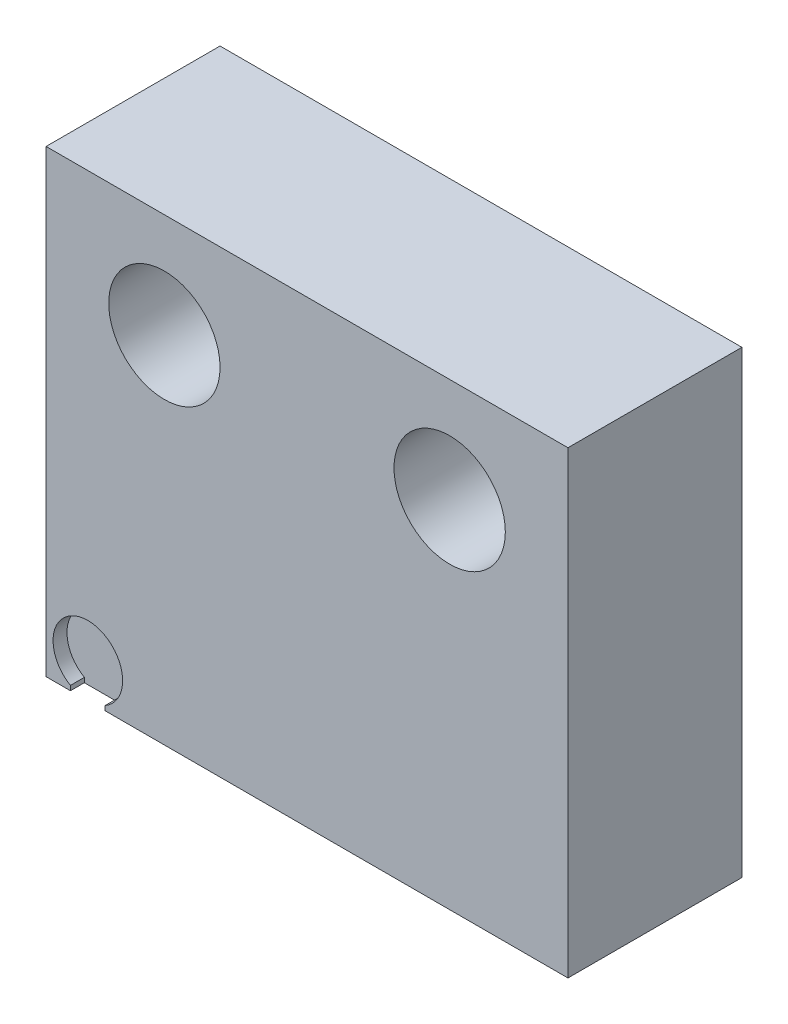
ISO-10303-21;
HEADER;
FILE_DESCRIPTION(('STEP AP214'),'2;1');
FILE_NAME('part.step','',(''),(''),'','','');
FILE_SCHEMA(('AUTOMOTIVE_DESIGN { 1 0 10303 214 1 1 1 1 }'));
ENDSEC;
DATA;
#1=APPLICATION_CONTEXT('core data for automotive mechanical design processes');
#2=APPLICATION_PROTOCOL_DEFINITION('international standard','automotive_design',2000,#1);
#3=PRODUCT_CONTEXT('',#1,'mechanical');
#4=PRODUCT('Part','Part','',(#3));
#5=PRODUCT_RELATED_PRODUCT_CATEGORY('part','',(#4));
#6=PRODUCT_DEFINITION_FORMATION('','',#4);
#7=PRODUCT_DEFINITION_CONTEXT('part definition',#1,'design');
#8=PRODUCT_DEFINITION('design','',#6,#7);
#9=PRODUCT_DEFINITION_SHAPE('','',#8);
#10=(LENGTH_UNIT() NAMED_UNIT(*) SI_UNIT(.MILLI.,.METRE.));
#11=(NAMED_UNIT(*) PLANE_ANGLE_UNIT() SI_UNIT($,.RADIAN.));
#12=(NAMED_UNIT(*) SI_UNIT($,.STERADIAN.) SOLID_ANGLE_UNIT());
#13=UNCERTAINTY_MEASURE_WITH_UNIT(LENGTH_MEASURE(1.E-05),#10,'distance_accuracy_value','');
#14=(GEOMETRIC_REPRESENTATION_CONTEXT(3) GLOBAL_UNCERTAINTY_ASSIGNED_CONTEXT((#13)) GLOBAL_UNIT_ASSIGNED_CONTEXT((#10,
#11,#12)) REPRESENTATION_CONTEXT('',''));
#15=CARTESIAN_POINT('',(0.,0.,0.));
#16=DIRECTION('',(0.,0.,1.));
#17=DIRECTION('',(1.,0.,0.));
#18=AXIS2_PLACEMENT_3D('',#15,#16,#17);
#19=CARTESIAN_POINT('',(2.2,0.,1.75));
#20=DIRECTION('',(0.,0.,1.));
#21=DIRECTION('',(1.,0.,0.));
#22=AXIS2_PLACEMENT_3D('',#19,#20,#21);
#23=PLANE('',#22);
#24=DIRECTION('',(0.,1.,0.));
#25=VECTOR('',#24,1.);
#26=CARTESIAN_POINT('',(1.,0.,1.75));
#27=LINE('',#26,#25);
#28=CARTESIAN_POINT('',(1.,0.,1.75));
#29=VERTEX_POINT('',#28);
#30=CARTESIAN_POINT('',(1.,2.,1.75));
#31=VERTEX_POINT('',#30);
#32=EDGE_CURVE('E102',#29,#31,#27,.T.);
#33=ORIENTED_EDGE('',*,*,#32,.T.);
#34=DIRECTION('',(1.,0.,0.));
#35=VECTOR('',#34,1.);
#36=CARTESIAN_POINT('',(3.75,2.,1.75));
#37=LINE('',#36,#35);
#38=CARTESIAN_POINT('',(2.2,2.,1.75));
#39=VERTEX_POINT('',#38);
#40=EDGE_CURVE('E247',#39,#31,#37,.F.);
#41=ORIENTED_EDGE('',*,*,#40,.F.);
#42=DIRECTION('',(0.,1.,0.));
#43=VECTOR('',#42,1.);
#44=CARTESIAN_POINT('',(2.2,0.,1.75));
#45=LINE('',#44,#43);
#46=CARTESIAN_POINT('',(2.2,0.,1.75));
#47=VERTEX_POINT('',#46);
#48=EDGE_CURVE('E241',#39,#47,#45,.F.);
#49=ORIENTED_EDGE('',*,*,#48,.T.);
#50=DIRECTION('',(1.,0.,0.));
#51=VECTOR('',#50,1.);
#52=CARTESIAN_POINT('',(2.2,0.,1.75));
#53=LINE('',#52,#51);
#54=EDGE_CURVE('E80',#29,#47,#53,.T.);
#55=ORIENTED_EDGE('',*,*,#54,.F.);
#56=EDGE_LOOP('',(#33,#41,#49,#55));
#57=FACE_BOUND('',#56,.T.);
#58=ADVANCED_FACE('F17',(#57),#23,.F.);
#59=CARTESIAN_POINT('',(3.75,3.3,2.3));
#60=DIRECTION('',(0.,0.,1.));
#61=DIRECTION('',(1.,0.,0.));
#62=AXIS2_PLACEMENT_3D('',#59,#60,#61);
#63=PLANE('',#62);
#64=CARTESIAN_POINT('',(0.6,0.5,2.3));
#65=DIRECTION('',(0.,0.,1.));
#66=DIRECTION('',(1.,0.,0.));
#67=AXIS2_PLACEMENT_3D('',#64,#65,#66);
#68=CIRCLE('',#67,0.5);
#69=CARTESIAN_POINT('',(0.85,0.0669872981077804,2.3));
#70=VERTEX_POINT('',#69);
#71=CARTESIAN_POINT('',(0.35,0.0669872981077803,2.3));
#72=VERTEX_POINT('',#71);
#73=EDGE_CURVE('E20',#70,#72,#68,.T.);
#74=ORIENTED_EDGE('',*,*,#73,.T.);
#75=DIRECTION('',(0.,1.,0.));
#76=VECTOR('',#75,1.);
#77=CARTESIAN_POINT('',(0.35,3.3,2.3));
#78=LINE('',#77,#76);
#79=CARTESIAN_POINT('',(0.35,0.,2.3));
#80=VERTEX_POINT('',#79);
#81=EDGE_CURVE('E97',#72,#80,#78,.F.);
#82=ORIENTED_EDGE('',*,*,#81,.T.);
#83=DIRECTION('',(1.,0.,0.));
#84=VECTOR('',#83,1.);
#85=CARTESIAN_POINT('',(3.75,0.,2.3));
#86=LINE('',#85,#84);
#87=CARTESIAN_POINT('',(0.85,0.,2.3));
#88=VERTEX_POINT('',#87);
#89=EDGE_CURVE('E95',#80,#88,#86,.T.);
#90=ORIENTED_EDGE('',*,*,#89,.T.);
#91=DIRECTION('',(0.,1.,0.));
#92=VECTOR('',#91,1.);
#93=CARTESIAN_POINT('',(0.85,3.3,2.3));
#94=LINE('',#93,#92);
#95=EDGE_CURVE('E69',#88,#70,#94,.T.);
#96=ORIENTED_EDGE('',*,*,#95,.T.);
#97=EDGE_LOOP('',(#74,#82,#90,#96));
#98=FACE_BOUND('',#97,.T.);
#99=ADVANCED_FACE('F99',(#98),#63,.T.);
#100=CARTESIAN_POINT('',(1.,0.,1.75));
#101=DIRECTION('',(-1.,0.,0.));
#102=DIRECTION('',(0.,0.,1.));
#103=AXIS2_PLACEMENT_3D('',#100,#101,#102);
#104=PLANE('',#103);
#105=DIRECTION('',(0.,1.,0.));
#106=VECTOR('',#105,1.);
#107=CARTESIAN_POINT('',(1.,0.,0.75));
#108=LINE('',#107,#106);
#109=CARTESIAN_POINT('',(1.,0.,0.75));
#110=VERTEX_POINT('',#109);
#111=CARTESIAN_POINT('',(1.,2.,0.75));
#112=VERTEX_POINT('',#111);
#113=EDGE_CURVE('E201',#110,#112,#108,.T.);
#114=ORIENTED_EDGE('',*,*,#113,.T.);
#115=DIRECTION('',(0.,0.,-1.));
#116=VECTOR('',#115,1.);
#117=CARTESIAN_POINT('',(1.,2.,1.25));
#118=LINE('',#117,#116);
#119=EDGE_CURVE('E250',#31,#112,#118,.T.);
#120=ORIENTED_EDGE('',*,*,#119,.F.);
#121=ORIENTED_EDGE('',*,*,#32,.F.);
#122=DIRECTION('',(0.,0.,1.));
#123=VECTOR('',#122,1.);
#124=CARTESIAN_POINT('',(1.,0.,1.75));
#125=LINE('',#124,#123);
#126=EDGE_CURVE('E253',#110,#29,#125,.T.);
#127=ORIENTED_EDGE('',*,*,#126,.F.);
#128=EDGE_LOOP('',(#114,#120,#121,#127));
#129=FACE_BOUND('',#128,.T.);
#130=ADVANCED_FACE('F268',(#129),#104,.F.);
#131=CARTESIAN_POINT('',(3.75,2.,1.25));
#132=DIRECTION('',(0.,-1.,0.));
#133=DIRECTION('',(0.,0.,-1.));
#134=AXIS2_PLACEMENT_3D('',#131,#132,#133);
#135=PLANE('',#134);
#136=DIRECTION('',(0.,0.,-1.));
#137=VECTOR('',#136,1.);
#138=CARTESIAN_POINT('',(2.2,2.,0.75));
#139=LINE('',#138,#137);
#140=CARTESIAN_POINT('',(2.2,2.,0.75));
#141=VERTEX_POINT('',#140);
#142=EDGE_CURVE('E244',#141,#39,#139,.F.);
#143=ORIENTED_EDGE('',*,*,#142,.T.);
#144=ORIENTED_EDGE('',*,*,#40,.T.);
#145=ORIENTED_EDGE('',*,*,#119,.T.);
#146=DIRECTION('',(-1.,0.,0.));
#147=VECTOR('',#146,1.);
#148=CARTESIAN_POINT('',(1.,2.,0.75));
#149=LINE('',#148,#147);
#150=EDGE_CURVE('E198',#112,#141,#149,.F.);
#151=ORIENTED_EDGE('',*,*,#150,.T.);
#152=EDGE_LOOP('',(#143,#144,#145,#151));
#153=FACE_BOUND('',#152,.T.);
#154=ADVANCED_FACE('F265',(#153),#135,.T.);
#155=CARTESIAN_POINT('',(2.2,0.,0.75));
#156=DIRECTION('',(1.,0.,0.));
#157=DIRECTION('',(0.,0.,-1.));
#158=AXIS2_PLACEMENT_3D('',#155,#156,#157);
#159=PLANE('',#158);
#160=ORIENTED_EDGE('',*,*,#48,.F.);
#161=ORIENTED_EDGE('',*,*,#142,.F.);
#162=DIRECTION('',(0.,1.,0.));
#163=VECTOR('',#162,1.);
#164=CARTESIAN_POINT('',(2.2,0.,0.75));
#165=LINE('',#164,#163);
#166=CARTESIAN_POINT('',(2.2,0.,0.75));
#167=VERTEX_POINT('',#166);
#168=EDGE_CURVE('E195',#141,#167,#165,.F.);
#169=ORIENTED_EDGE('',*,*,#168,.T.);
#170=DIRECTION('',(0.,0.,-1.));
#171=VECTOR('',#170,1.);
#172=CARTESIAN_POINT('',(2.2,0.,0.75));
#173=LINE('',#172,#171);
#174=EDGE_CURVE('E239',#47,#167,#173,.T.);
#175=ORIENTED_EDGE('',*,*,#174,.F.);
#176=EDGE_LOOP('',(#160,#161,#169,#175));
#177=FACE_BOUND('',#176,.T.);
#178=ADVANCED_FACE('F410',(#177),#159,.F.);
#179=CARTESIAN_POINT('',(0.3,3.3,1.25));
#180=DIRECTION('',(-1.,0.,0.));
#181=DIRECTION('',(0.,0.,1.));
#182=AXIS2_PLACEMENT_3D('',#179,#180,#181);
#183=PLANE('',#182);
#184=DIRECTION('',(0.,0.,1.));
#185=VECTOR('',#184,1.);
#186=CARTESIAN_POINT('',(0.3,1.6,2.15));
#187=LINE('',#186,#185);
#188=CARTESIAN_POINT('',(0.3,1.6,2.15));
#189=VERTEX_POINT('',#188);
#190=CARTESIAN_POINT('',(0.3,1.6,0.35));
#191=VERTEX_POINT('',#190);
#192=EDGE_CURVE('E186',#189,#191,#187,.F.);
#193=ORIENTED_EDGE('',*,*,#192,.T.);
#194=DIRECTION('',(0.,1.,0.));
#195=VECTOR('',#194,1.);
#196=CARTESIAN_POINT('',(0.3,1.6,0.35));
#197=LINE('',#196,#195);
#198=CARTESIAN_POINT('',(0.299999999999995,0.399999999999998,0.35));
#199=VERTEX_POINT('',#198);
#200=EDGE_CURVE('E189',#191,#199,#197,.F.);
#201=ORIENTED_EDGE('',*,*,#200,.T.);
#202=DIRECTION('',(0.,0.,1.));
#203=VECTOR('',#202,1.);
#204=CARTESIAN_POINT('',(0.299999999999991,0.399999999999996,1.25));
#205=LINE('',#204,#203);
#206=CARTESIAN_POINT('',(0.299999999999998,0.399999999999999,2.15));
#207=VERTEX_POINT('',#206);
#208=EDGE_CURVE('E217',#207,#199,#205,.F.);
#209=ORIENTED_EDGE('',*,*,#208,.F.);
#210=DIRECTION('',(0.,1.,0.));
#211=VECTOR('',#210,1.);
#212=CARTESIAN_POINT('',(0.3,3.3,2.15));
#213=LINE('',#212,#211);
#214=EDGE_CURVE('E236',#207,#189,#213,.T.);
#215=ORIENTED_EDGE('',*,*,#214,.T.);
#216=EDGE_LOOP('',(#193,#201,#209,#215));
#217=FACE_BOUND('',#216,.T.);
#218=ADVANCED_FACE('F401',(#217),#183,.T.);
#219=CARTESIAN_POINT('',(0.6,0.5,2.5));
#220=DIRECTION('',(0.,0.,1.));
#221=DIRECTION('',(1.,0.,0.));
#222=AXIS2_PLACEMENT_3D('',#219,#220,#221);
#223=CYLINDRICAL_SURFACE('',#222,0.5);
#224=DIRECTION('',(0.,0.,1.));
#225=VECTOR('',#224,1.);
#226=CARTESIAN_POINT('',(0.35,0.06698729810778,2.5));
#227=LINE('',#226,#225);
#228=CARTESIAN_POINT('',(0.35,0.0669872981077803,2.5));
#229=VERTEX_POINT('',#228);
#230=EDGE_CURVE('E204',#229,#72,#227,.F.);
#231=ORIENTED_EDGE('',*,*,#230,.T.);
#232=ORIENTED_EDGE('',*,*,#73,.F.);
#233=DIRECTION('',(0.,0.,-1.));
#234=VECTOR('',#233,1.);
#235=CARTESIAN_POINT('',(0.85,0.06698729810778,2.5));
#236=LINE('',#235,#234);
#237=CARTESIAN_POINT('',(0.85,0.0669872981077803,2.5));
#238=VERTEX_POINT('',#237);
#239=EDGE_CURVE('E220',#70,#238,#236,.F.);
#240=ORIENTED_EDGE('',*,*,#239,.T.);
#241=CARTESIAN_POINT('',(0.6,0.5,2.5));
#242=DIRECTION('',(0.,0.,1.));
#243=DIRECTION('',(1.,0.,0.));
#244=AXIS2_PLACEMENT_3D('',#241,#242,#243);
#245=CIRCLE('',#244,0.5);
#246=EDGE_CURVE('E142',#229,#238,#245,.F.);
#247=ORIENTED_EDGE('',*,*,#246,.F.);
#248=EDGE_LOOP('',(#231,#232,#240,#247));
#249=FACE_BOUND('',#248,.T.);
#250=ADVANCED_FACE('F398',(#249),#223,.F.);
#251=CARTESIAN_POINT('',(0.4,0.2,1.25));
#252=DIRECTION('',(-0.894427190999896,-0.447213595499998,0.));
#253=DIRECTION('',(0.447213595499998,-0.894427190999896,0.));
#254=AXIS2_PLACEMENT_3D('',#251,#252,#253);
#255=PLANE('',#254);
#256=DIRECTION('',(0.,0.,-1.));
#257=VECTOR('',#256,1.);
#258=CARTESIAN_POINT('',(0.5,0.,0.));
#259=LINE('',#258,#257);
#260=CARTESIAN_POINT('',(0.500000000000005,0.,2.15));
#261=VERTEX_POINT('',#260);
#262=CARTESIAN_POINT('',(0.500000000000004,0.,0.35));
#263=VERTEX_POINT('',#262);
#264=EDGE_CURVE('E162',#261,#263,#259,.T.);
#265=ORIENTED_EDGE('',*,*,#264,.F.);
#266=DIRECTION('',(-0.447213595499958,0.894427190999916,0.));
#267=VECTOR('',#266,1.);
#268=CARTESIAN_POINT('',(0.5,0.,2.15));
#269=LINE('',#268,#267);
#270=EDGE_CURVE('E153',#261,#207,#269,.T.);
#271=ORIENTED_EDGE('',*,*,#270,.T.);
#272=ORIENTED_EDGE('',*,*,#208,.T.);
#273=DIRECTION('',(0.447213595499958,-0.894427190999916,0.));
#274=VECTOR('',#273,1.);
#275=CARTESIAN_POINT('',(0.3,0.4,0.35));
#276=LINE('',#275,#274);
#277=EDGE_CURVE('E192',#199,#263,#276,.T.);
#278=ORIENTED_EDGE('',*,*,#277,.T.);
#279=EDGE_LOOP('',(#265,#271,#272,#278));
#280=FACE_BOUND('',#279,.T.);
#281=ADVANCED_FACE('F400',(#280),#255,.T.);
#282=CARTESIAN_POINT('',(0.85,0.,2.5));
#283=DIRECTION('',(1.,0.,0.));
#284=DIRECTION('',(0.,0.,-1.));
#285=AXIS2_PLACEMENT_3D('',#282,#283,#284);
#286=PLANE('',#285);
#287=ORIENTED_EDGE('',*,*,#239,.F.);
#288=ORIENTED_EDGE('',*,*,#95,.F.);
#289=DIRECTION('',(0.,0.,-1.));
#290=VECTOR('',#289,1.);
#291=CARTESIAN_POINT('',(0.85,0.,0.));
#292=LINE('',#291,#290);
#293=CARTESIAN_POINT('',(0.85,0.,2.5));
#294=VERTEX_POINT('',#293);
#295=EDGE_CURVE('E114',#294,#88,#292,.T.);
#296=ORIENTED_EDGE('',*,*,#295,.F.);
#297=DIRECTION('',(0.,1.,0.));
#298=VECTOR('',#297,1.);
#299=CARTESIAN_POINT('',(0.85,0.,2.5));
#300=LINE('',#299,#298);
#301=EDGE_CURVE('E143',#238,#294,#300,.F.);
#302=ORIENTED_EDGE('',*,*,#301,.F.);
#303=EDGE_LOOP('',(#287,#288,#296,#302));
#304=FACE_BOUND('',#303,.T.);
#305=ADVANCED_FACE('F396',(#304),#286,.F.);
#306=CARTESIAN_POINT('',(0.35,0.06698729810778,2.5));
#307=DIRECTION('',(-1.,0.,0.));
#308=DIRECTION('',(0.,0.,1.));
#309=AXIS2_PLACEMENT_3D('',#306,#307,#308);
#310=PLANE('',#309);
#311=DIRECTION('',(0.,0.,-1.));
#312=VECTOR('',#311,1.);
#313=CARTESIAN_POINT('',(0.35,0.,0.));
#314=LINE('',#313,#312);
#315=CARTESIAN_POINT('',(0.35,0.,2.5));
#316=VERTEX_POINT('',#315);
#317=EDGE_CURVE('E106',#80,#316,#314,.F.);
#318=ORIENTED_EDGE('',*,*,#317,.F.);
#319=ORIENTED_EDGE('',*,*,#81,.F.);
#320=ORIENTED_EDGE('',*,*,#230,.F.);
#321=DIRECTION('',(0.,1.,0.));
#322=VECTOR('',#321,1.);
#323=CARTESIAN_POINT('',(0.35,0.,2.5));
#324=LINE('',#323,#322);
#325=EDGE_CURVE('E109',#316,#229,#324,.T.);
#326=ORIENTED_EDGE('',*,*,#325,.F.);
#327=EDGE_LOOP('',(#318,#319,#320,#326));
#328=FACE_BOUND('',#327,.T.);
#329=ADVANCED_FACE('F107',(#328),#310,.F.);
#330=CARTESIAN_POINT('',(1.,0.,0.75));
#331=DIRECTION('',(0.,0.,-1.));
#332=DIRECTION('',(-1.,0.,0.));
#333=AXIS2_PLACEMENT_3D('',#330,#331,#332);
#334=PLANE('',#333);
#335=ORIENTED_EDGE('',*,*,#168,.F.);
#336=ORIENTED_EDGE('',*,*,#150,.F.);
#337=ORIENTED_EDGE('',*,*,#113,.F.);
#338=DIRECTION('',(1.,0.,0.));
#339=VECTOR('',#338,1.);
#340=CARTESIAN_POINT('',(0.,0.,0.75));
#341=LINE('',#340,#339);
#342=EDGE_CURVE('E279',#167,#110,#341,.F.);
#343=ORIENTED_EDGE('',*,*,#342,.F.);
#344=EDGE_LOOP('',(#335,#336,#337,#343));
#345=FACE_BOUND('',#344,.T.);
#346=ADVANCED_FACE('F277',(#345),#334,.F.);
#347=CARTESIAN_POINT('',(0.,1.6,0.35));
#348=DIRECTION('',(0.,0.,-1.));
#349=DIRECTION('',(-1.,0.,0.));
#350=AXIS2_PLACEMENT_3D('',#347,#348,#349);
#351=PLANE('',#350);
#352=DIRECTION('',(1.,0.,0.));
#353=VECTOR('',#352,1.);
#354=CARTESIAN_POINT('',(0.,1.6,0.35));
#355=LINE('',#354,#353);
#356=CARTESIAN_POINT('',(0.,1.6,0.35));
#357=VERTEX_POINT('',#356);
#358=EDGE_CURVE('E183',#191,#357,#355,.F.);
#359=ORIENTED_EDGE('',*,*,#358,.T.);
#360=DIRECTION('',(0.,1.,0.));
#361=VECTOR('',#360,1.);
#362=CARTESIAN_POINT('',(0.,6.6,0.35));
#363=LINE('',#362,#361);
#364=CARTESIAN_POINT('',(0.,0.,0.35));
#365=VERTEX_POINT('',#364);
#366=EDGE_CURVE('E347',#365,#357,#363,.T.);
#367=ORIENTED_EDGE('',*,*,#366,.F.);
#368=DIRECTION('',(1.,0.,0.));
#369=VECTOR('',#368,1.);
#370=CARTESIAN_POINT('',(0.,0.,0.35));
#371=LINE('',#370,#369);
#372=EDGE_CURVE('E173',#263,#365,#371,.F.);
#373=ORIENTED_EDGE('',*,*,#372,.F.);
#374=ORIENTED_EDGE('',*,*,#277,.F.);
#375=ORIENTED_EDGE('',*,*,#200,.F.);
#376=EDGE_LOOP('',(#359,#367,#373,#374,#375));
#377=FACE_BOUND('',#376,.T.);
#378=ADVANCED_FACE('F464',(#377),#351,.F.);
#379=CARTESIAN_POINT('',(0.,1.6,2.15));
#380=DIRECTION('',(0.,1.,0.));
#381=DIRECTION('',(0.,0.,1.));
#382=AXIS2_PLACEMENT_3D('',#379,#380,#381);
#383=PLANE('',#382);
#384=ORIENTED_EDGE('',*,*,#358,.F.);
#385=ORIENTED_EDGE('',*,*,#192,.F.);
#386=DIRECTION('',(1.,0.,0.));
#387=VECTOR('',#386,1.);
#388=CARTESIAN_POINT('',(0.,1.6,2.15));
#389=LINE('',#388,#387);
#390=CARTESIAN_POINT('',(0.,1.6,2.15));
#391=VERTEX_POINT('',#390);
#392=EDGE_CURVE('E150',#189,#391,#389,.F.);
#393=ORIENTED_EDGE('',*,*,#392,.T.);
#394=DIRECTION('',(0.,0.,1.));
#395=VECTOR('',#394,1.);
#396=CARTESIAN_POINT('',(0.,1.6,0.));
#397=LINE('',#396,#395);
#398=EDGE_CURVE('E344',#357,#391,#397,.T.);
#399=ORIENTED_EDGE('',*,*,#398,.F.);
#400=EDGE_LOOP('',(#384,#385,#393,#399));
#401=FACE_BOUND('',#400,.T.);
#402=ADVANCED_FACE('F460',(#401),#383,.F.);
#403=CARTESIAN_POINT('',(0.,0.,2.15));
#404=DIRECTION('',(0.,0.,1.));
#405=DIRECTION('',(1.,0.,0.));
#406=AXIS2_PLACEMENT_3D('',#403,#404,#405);
#407=PLANE('',#406);
#408=DIRECTION('',(0.,1.,0.));
#409=VECTOR('',#408,1.);
#410=CARTESIAN_POINT('',(0.,6.6,2.15));
#411=LINE('',#410,#409);
#412=CARTESIAN_POINT('',(0.,0.,2.15));
#413=VERTEX_POINT('',#412);
#414=EDGE_CURVE('E341',#391,#413,#411,.F.);
#415=ORIENTED_EDGE('',*,*,#414,.F.);
#416=ORIENTED_EDGE('',*,*,#392,.F.);
#417=ORIENTED_EDGE('',*,*,#214,.F.);
#418=ORIENTED_EDGE('',*,*,#270,.F.);
#419=DIRECTION('',(1.,0.,0.));
#420=VECTOR('',#419,1.);
#421=CARTESIAN_POINT('',(0.,0.,2.15));
#422=LINE('',#421,#420);
#423=EDGE_CURVE('E233',#413,#261,#422,.T.);
#424=ORIENTED_EDGE('',*,*,#423,.F.);
#425=EDGE_LOOP('',(#415,#416,#417,#418,#424));
#426=FACE_BOUND('',#425,.T.);
#427=ADVANCED_FACE('F456',(#426),#407,.F.);
#428=CARTESIAN_POINT('',(0.,0.,0.2));
#429=DIRECTION('',(0.,0.,1.));
#430=DIRECTION('',(1.,0.,0.));
#431=AXIS2_PLACEMENT_3D('',#428,#429,#430);
#432=PLANE('',#431);
#433=DIRECTION('',(0.,1.,0.));
#434=VECTOR('',#433,1.);
#435=CARTESIAN_POINT('',(0.35,0.06698729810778,0.2));
#436=LINE('',#435,#434);
#437=CARTESIAN_POINT('',(0.35,0.,0.2));
#438=VERTEX_POINT('',#437);
#439=CARTESIAN_POINT('',(0.35,0.0669872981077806,0.2));
#440=VERTEX_POINT('',#439);
#441=EDGE_CURVE('E165',#438,#440,#436,.T.);
#442=ORIENTED_EDGE('',*,*,#441,.T.);
#443=CARTESIAN_POINT('',(0.6,0.5,0.2));
#444=DIRECTION('',(0.,0.,1.));
#445=DIRECTION('',(1.,0.,0.));
#446=AXIS2_PLACEMENT_3D('',#443,#444,#445);
#447=CIRCLE('',#446,0.5);
#448=CARTESIAN_POINT('',(0.85,0.0669872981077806,0.2));
#449=VERTEX_POINT('',#448);
#450=EDGE_CURVE('E140',#440,#449,#447,.F.);
#451=ORIENTED_EDGE('',*,*,#450,.T.);
#452=DIRECTION('',(0.,1.,0.));
#453=VECTOR('',#452,1.);
#454=CARTESIAN_POINT('',(0.85,0.,0.2));
#455=LINE('',#454,#453);
#456=CARTESIAN_POINT('',(0.85,0.,0.2));
#457=VERTEX_POINT('',#456);
#458=EDGE_CURVE('E148',#449,#457,#455,.F.);
#459=ORIENTED_EDGE('',*,*,#458,.T.);
#460=DIRECTION('',(1.,0.,0.));
#461=VECTOR('',#460,1.);
#462=CARTESIAN_POINT('',(0.,0.,0.2));
#463=LINE('',#462,#461);
#464=EDGE_CURVE('E172',#438,#457,#463,.T.);
#465=ORIENTED_EDGE('',*,*,#464,.F.);
#466=EDGE_LOOP('',(#442,#451,#459,#465));
#467=FACE_BOUND('',#466,.T.);
#468=ADVANCED_FACE('F452',(#467),#432,.F.);
#469=CARTESIAN_POINT('',(0.,0.,2.5));
#470=DIRECTION('',(0.,0.,1.));
#471=DIRECTION('',(1.,0.,0.));
#472=AXIS2_PLACEMENT_3D('',#469,#470,#471);
#473=PLANE('',#472);
#474=CARTESIAN_POINT('',(5.8,5.1,2.5));
#475=DIRECTION('',(0.,0.,1.));
#476=DIRECTION('',(1.,0.,0.));
#477=AXIS2_PLACEMENT_3D('',#474,#475,#476);
#478=CIRCLE('',#477,0.8);
#479=CARTESIAN_POINT('',(6.6,5.1,2.5));
#480=VERTEX_POINT('',#479);
#481=EDGE_CURVE('E132',#480,#480,#478,.F.);
#482=ORIENTED_EDGE('',*,*,#481,.T.);
#483=EDGE_LOOP('',(#482));
#484=FACE_BOUND('',#483,.T.);
#485=CARTESIAN_POINT('',(1.7,5.1,2.5));
#486=DIRECTION('',(0.,0.,1.));
#487=DIRECTION('',(1.,0.,0.));
#488=AXIS2_PLACEMENT_3D('',#485,#486,#487);
#489=CIRCLE('',#488,0.8);
#490=CARTESIAN_POINT('',(2.5,5.1,2.5));
#491=VERTEX_POINT('',#490);
#492=EDGE_CURVE('E136',#491,#491,#489,.F.);
#493=ORIENTED_EDGE('',*,*,#492,.T.);
#494=EDGE_LOOP('',(#493));
#495=FACE_BOUND('',#494,.T.);
#496=DIRECTION('',(0.,1.,0.));
#497=VECTOR('',#496,1.);
#498=CARTESIAN_POINT('',(0.,6.6,2.5));
#499=LINE('',#498,#497);
#500=CARTESIAN_POINT('',(0.,0.,2.5));
#501=VERTEX_POINT('',#500);
#502=CARTESIAN_POINT('',(0.,6.6,2.5));
#503=VERTEX_POINT('',#502);
#504=EDGE_CURVE('E335',#501,#503,#499,.T.);
#505=ORIENTED_EDGE('',*,*,#504,.F.);
#506=DIRECTION('',(1.,0.,0.));
#507=VECTOR('',#506,1.);
#508=CARTESIAN_POINT('',(0.,0.,2.5));
#509=LINE('',#508,#507);
#510=EDGE_CURVE('E113',#316,#501,#509,.F.);
#511=ORIENTED_EDGE('',*,*,#510,.F.);
#512=ORIENTED_EDGE('',*,*,#325,.T.);
#513=ORIENTED_EDGE('',*,*,#246,.T.);
#514=ORIENTED_EDGE('',*,*,#301,.T.);
#515=DIRECTION('',(1.,0.,0.));
#516=VECTOR('',#515,1.);
#517=CARTESIAN_POINT('',(0.,0.,2.5));
#518=LINE('',#517,#516);
#519=CARTESIAN_POINT('',(7.5,0.,2.5));
#520=VERTEX_POINT('',#519);
#521=EDGE_CURVE('E222',#520,#294,#518,.F.);
#522=ORIENTED_EDGE('',*,*,#521,.F.);
#523=DIRECTION('',(0.,1.,0.));
#524=VECTOR('',#523,1.);
#525=CARTESIAN_POINT('',(7.5,0.,2.5));
#526=LINE('',#525,#524);
#527=CARTESIAN_POINT('',(7.5,6.6,2.5));
#528=VERTEX_POINT('',#527);
#529=EDGE_CURVE('E281',#528,#520,#526,.F.);
#530=ORIENTED_EDGE('',*,*,#529,.F.);
#531=DIRECTION('',(1.,0.,0.));
#532=VECTOR('',#531,1.);
#533=CARTESIAN_POINT('',(7.5,6.6,2.5));
#534=LINE('',#533,#532);
#535=EDGE_CURVE('E353',#503,#528,#534,.T.);
#536=ORIENTED_EDGE('',*,*,#535,.F.);
#537=EDGE_LOOP('',(#505,#511,#512,#513,#514,#522,#530,#536));
#538=FACE_BOUND('',#537,.T.);
#539=ADVANCED_FACE('F393',(#484,#495,#538),#473,.T.);
#540=CARTESIAN_POINT('',(0.85,0.,0.));
#541=DIRECTION('',(1.,0.,0.));
#542=DIRECTION('',(0.,0.,-1.));
#543=AXIS2_PLACEMENT_3D('',#540,#541,#542);
#544=PLANE('',#543);
#545=DIRECTION('',(0.,0.,-1.));
#546=VECTOR('',#545,1.);
#547=CARTESIAN_POINT('',(0.85,0.,0.));
#548=LINE('',#547,#546);
#549=CARTESIAN_POINT('',(0.85,0.,0.));
#550=VERTEX_POINT('',#549);
#551=EDGE_CURVE('E178',#457,#550,#548,.T.);
#552=ORIENTED_EDGE('',*,*,#551,.F.);
#553=ORIENTED_EDGE('',*,*,#458,.F.);
#554=DIRECTION('',(0.,0.,1.));
#555=VECTOR('',#554,1.);
#556=CARTESIAN_POINT('',(0.85,0.0669872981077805,0.));
#557=LINE('',#556,#555);
#558=CARTESIAN_POINT('',(0.85,0.0669872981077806,0.));
#559=VERTEX_POINT('',#558);
#560=EDGE_CURVE('E139',#449,#559,#557,.F.);
#561=ORIENTED_EDGE('',*,*,#560,.T.);
#562=DIRECTION('',(0.,1.,0.));
#563=VECTOR('',#562,1.);
#564=CARTESIAN_POINT('',(0.85,0.,0.));
#565=LINE('',#564,#563);
#566=EDGE_CURVE('E135',#559,#550,#565,.F.);
#567=ORIENTED_EDGE('',*,*,#566,.T.);
#568=EDGE_LOOP('',(#552,#553,#561,#567));
#569=FACE_BOUND('',#568,.T.);
#570=ADVANCED_FACE('F320',(#569),#544,.F.);
#571=CARTESIAN_POINT('',(0.,0.,0.));
#572=DIRECTION('',(0.,-1.,0.));
#573=DIRECTION('',(0.,0.,-1.));
#574=AXIS2_PLACEMENT_3D('',#571,#572,#573);
#575=PLANE('',#574);
#576=ORIENTED_EDGE('',*,*,#174,.T.);
#577=ORIENTED_EDGE('',*,*,#342,.T.);
#578=ORIENTED_EDGE('',*,*,#126,.T.);
#579=ORIENTED_EDGE('',*,*,#54,.T.);
#580=EDGE_LOOP('',(#576,#577,#578,#579));
#581=FACE_BOUND('',#580,.T.);
#582=DIRECTION('',(0.,0.,1.));
#583=VECTOR('',#582,1.);
#584=CARTESIAN_POINT('',(0.,0.,0.));
#585=LINE('',#584,#583);
#586=EDGE_CURVE('E338',#413,#501,#585,.T.);
#587=ORIENTED_EDGE('',*,*,#586,.F.);
#588=ORIENTED_EDGE('',*,*,#423,.T.);
#589=ORIENTED_EDGE('',*,*,#264,.T.);
#590=ORIENTED_EDGE('',*,*,#372,.T.);
#591=DIRECTION('',(0.,0.,1.));
#592=VECTOR('',#591,1.);
#593=CARTESIAN_POINT('',(0.,0.,0.));
#594=LINE('',#593,#592);
#595=CARTESIAN_POINT('',(0.,0.,0.));
#596=VERTEX_POINT('',#595);
#597=EDGE_CURVE('E205',#596,#365,#594,.T.);
#598=ORIENTED_EDGE('',*,*,#597,.F.);
#599=DIRECTION('',(1.,0.,0.));
#600=VECTOR('',#599,1.);
#601=CARTESIAN_POINT('',(0.,0.,0.));
#602=LINE('',#601,#600);
#603=CARTESIAN_POINT('',(0.35,0.,0.));
#604=VERTEX_POINT('',#603);
#605=EDGE_CURVE('E170',#596,#604,#602,.T.);
#606=ORIENTED_EDGE('',*,*,#605,.T.);
#607=DIRECTION('',(0.,0.,1.));
#608=VECTOR('',#607,1.);
#609=CARTESIAN_POINT('',(0.35,0.,0.));
#610=LINE('',#609,#608);
#611=EDGE_CURVE('E167',#604,#438,#610,.T.);
#612=ORIENTED_EDGE('',*,*,#611,.T.);
#613=ORIENTED_EDGE('',*,*,#464,.T.);
#614=ORIENTED_EDGE('',*,*,#551,.T.);
#615=DIRECTION('',(1.,0.,0.));
#616=VECTOR('',#615,1.);
#617=CARTESIAN_POINT('',(0.,0.,0.));
#618=LINE('',#617,#616);
#619=CARTESIAN_POINT('',(7.5,0.,0.));
#620=VERTEX_POINT('',#619);
#621=EDGE_CURVE('E294',#550,#620,#618,.T.);
#622=ORIENTED_EDGE('',*,*,#621,.T.);
#623=DIRECTION('',(0.,0.,-1.));
#624=VECTOR('',#623,1.);
#625=CARTESIAN_POINT('',(7.5,0.,0.));
#626=LINE('',#625,#624);
#627=EDGE_CURVE('E284',#520,#620,#626,.T.);
#628=ORIENTED_EDGE('',*,*,#627,.F.);
#629=ORIENTED_EDGE('',*,*,#521,.T.);
#630=ORIENTED_EDGE('',*,*,#295,.T.);
#631=ORIENTED_EDGE('',*,*,#89,.F.);
#632=ORIENTED_EDGE('',*,*,#317,.T.);
#633=ORIENTED_EDGE('',*,*,#510,.T.);
#634=EDGE_LOOP('',(#587,#588,#589,#590,#598,#606,#612,#613,#614,#622,#628,#629,#630,#631,#632,#633));
#635=FACE_BOUND('',#634,.T.);
#636=ADVANCED_FACE('F117',(#581,#635),#575,.T.);
#637=CARTESIAN_POINT('',(7.5,0.,0.));
#638=DIRECTION('',(1.,0.,0.));
#639=DIRECTION('',(0.,0.,-1.));
#640=AXIS2_PLACEMENT_3D('',#637,#638,#639);
#641=PLANE('',#640);
#642=ORIENTED_EDGE('',*,*,#529,.T.);
#643=ORIENTED_EDGE('',*,*,#627,.T.);
#644=DIRECTION('',(0.,1.,0.));
#645=VECTOR('',#644,1.);
#646=CARTESIAN_POINT('',(7.5,0.,0.));
#647=LINE('',#646,#645);
#648=CARTESIAN_POINT('',(7.5,6.6,0.));
#649=VERTEX_POINT('',#648);
#650=EDGE_CURVE('E297',#620,#649,#647,.T.);
#651=ORIENTED_EDGE('',*,*,#650,.T.);
#652=DIRECTION('',(0.,0.,1.));
#653=VECTOR('',#652,1.);
#654=CARTESIAN_POINT('',(7.5,6.6,0.));
#655=LINE('',#654,#653);
#656=EDGE_CURVE('E350',#528,#649,#655,.F.);
#657=ORIENTED_EDGE('',*,*,#656,.F.);
#658=EDGE_LOOP('',(#642,#643,#651,#657));
#659=FACE_BOUND('',#658,.T.);
#660=ADVANCED_FACE('F357',(#659),#641,.T.);
#661=CARTESIAN_POINT('',(7.5,6.6,0.));
#662=DIRECTION('',(0.,1.,0.));
#663=DIRECTION('',(0.,0.,1.));
#664=AXIS2_PLACEMENT_3D('',#661,#662,#663);
#665=PLANE('',#664);
#666=ORIENTED_EDGE('',*,*,#535,.T.);
#667=ORIENTED_EDGE('',*,*,#656,.T.);
#668=DIRECTION('',(1.,0.,0.));
#669=VECTOR('',#668,1.);
#670=CARTESIAN_POINT('',(0.,6.6,0.));
#671=LINE('',#670,#669);
#672=CARTESIAN_POINT('',(0.,6.6,0.));
#673=VERTEX_POINT('',#672);
#674=EDGE_CURVE('E214',#649,#673,#671,.F.);
#675=ORIENTED_EDGE('',*,*,#674,.T.);
#676=DIRECTION('',(0.,0.,1.));
#677=VECTOR('',#676,1.);
#678=CARTESIAN_POINT('',(0.,6.6,0.));
#679=LINE('',#678,#677);
#680=EDGE_CURVE('E208',#503,#673,#679,.F.);
#681=ORIENTED_EDGE('',*,*,#680,.F.);
#682=EDGE_LOOP('',(#666,#667,#675,#681));
#683=FACE_BOUND('',#682,.T.);
#684=ADVANCED_FACE('F439',(#683),#665,.T.);
#685=CARTESIAN_POINT('',(0.,6.6,0.));
#686=DIRECTION('',(-1.,0.,0.));
#687=DIRECTION('',(0.,0.,1.));
#688=AXIS2_PLACEMENT_3D('',#685,#686,#687);
#689=PLANE('',#688);
#690=DIRECTION('',(0.,1.,0.));
#691=VECTOR('',#690,1.);
#692=CARTESIAN_POINT('',(0.,0.,0.));
#693=LINE('',#692,#691);
#694=EDGE_CURVE('E211',#673,#596,#693,.F.);
#695=ORIENTED_EDGE('',*,*,#694,.T.);
#696=ORIENTED_EDGE('',*,*,#597,.T.);
#697=ORIENTED_EDGE('',*,*,#366,.T.);
#698=ORIENTED_EDGE('',*,*,#398,.T.);
#699=ORIENTED_EDGE('',*,*,#414,.T.);
#700=ORIENTED_EDGE('',*,*,#586,.T.);
#701=ORIENTED_EDGE('',*,*,#504,.T.);
#702=ORIENTED_EDGE('',*,*,#680,.T.);
#703=EDGE_LOOP('',(#695,#696,#697,#698,#699,#700,#701,#702));
#704=FACE_BOUND('',#703,.T.);
#705=ADVANCED_FACE('F435',(#704),#689,.T.);
#706=CARTESIAN_POINT('',(0.35,0.06698729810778,0.));
#707=DIRECTION('',(-1.,0.,0.));
#708=DIRECTION('',(0.,0.,1.));
#709=AXIS2_PLACEMENT_3D('',#706,#707,#708);
#710=PLANE('',#709);
#711=DIRECTION('',(0.,0.,1.));
#712=VECTOR('',#711,1.);
#713=CARTESIAN_POINT('',(0.35,0.0669872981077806,0.));
#714=LINE('',#713,#712);
#715=CARTESIAN_POINT('',(0.35,0.0669872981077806,0.));
#716=VERTEX_POINT('',#715);
#717=EDGE_CURVE('E35',#716,#440,#714,.T.);
#718=ORIENTED_EDGE('',*,*,#717,.T.);
#719=ORIENTED_EDGE('',*,*,#441,.F.);
#720=ORIENTED_EDGE('',*,*,#611,.F.);
#721=DIRECTION('',(0.,1.,0.));
#722=VECTOR('',#721,1.);
#723=CARTESIAN_POINT('',(0.35,0.,0.));
#724=LINE('',#723,#722);
#725=EDGE_CURVE('E131',#604,#716,#724,.T.);
#726=ORIENTED_EDGE('',*,*,#725,.T.);
#727=EDGE_LOOP('',(#718,#719,#720,#726));
#728=FACE_BOUND('',#727,.T.);
#729=ADVANCED_FACE('F432',(#728),#710,.F.);
#730=CARTESIAN_POINT('',(0.6,0.5,0.));
#731=DIRECTION('',(0.,0.,1.));
#732=DIRECTION('',(1.,0.,0.));
#733=AXIS2_PLACEMENT_3D('',#730,#731,#732);
#734=CYLINDRICAL_SURFACE('',#733,0.5);
#735=ORIENTED_EDGE('',*,*,#560,.F.);
#736=ORIENTED_EDGE('',*,*,#450,.F.);
#737=ORIENTED_EDGE('',*,*,#717,.F.);
#738=CARTESIAN_POINT('',(0.6,0.5,0.));
#739=DIRECTION('',(0.,0.,1.));
#740=DIRECTION('',(1.,0.,0.));
#741=AXIS2_PLACEMENT_3D('',#738,#739,#740);
#742=CIRCLE('',#741,0.5);
#743=EDGE_CURVE('E129',#716,#559,#742,.F.);
#744=ORIENTED_EDGE('',*,*,#743,.T.);
#745=EDGE_LOOP('',(#735,#736,#737,#744));
#746=FACE_BOUND('',#745,.T.);
#747=ADVANCED_FACE('F428',(#746),#734,.F.);
#748=CARTESIAN_POINT('',(1.7,5.1,0.));
#749=DIRECTION('',(0.,0.,1.));
#750=DIRECTION('',(1.,0.,0.));
#751=AXIS2_PLACEMENT_3D('',#748,#749,#750);
#752=CYLINDRICAL_SURFACE('',#751,0.8);
#753=ORIENTED_EDGE('',*,*,#492,.F.);
#754=EDGE_LOOP('',(#753));
#755=FACE_BOUND('',#754,.T.);
#756=CARTESIAN_POINT('',(1.7,5.1,0.));
#757=DIRECTION('',(0.,0.,1.));
#758=DIRECTION('',(1.,0.,0.));
#759=AXIS2_PLACEMENT_3D('',#756,#757,#758);
#760=CIRCLE('',#759,0.8);
#761=CARTESIAN_POINT('',(2.5,5.1,0.));
#762=VERTEX_POINT('',#761);
#763=EDGE_CURVE('E26',#762,#762,#760,.F.);
#764=ORIENTED_EDGE('',*,*,#763,.T.);
#765=EDGE_LOOP('',(#764));
#766=FACE_BOUND('',#765,.T.);
#767=ADVANCED_FACE('F420',(#755,#766),#752,.F.);
#768=CARTESIAN_POINT('',(5.8,5.1,0.));
#769=DIRECTION('',(0.,0.,1.));
#770=DIRECTION('',(1.,0.,0.));
#771=AXIS2_PLACEMENT_3D('',#768,#769,#770);
#772=CYLINDRICAL_SURFACE('',#771,0.8);
#773=ORIENTED_EDGE('',*,*,#481,.F.);
#774=EDGE_LOOP('',(#773));
#775=FACE_BOUND('',#774,.T.);
#776=CARTESIAN_POINT('',(5.8,5.1,0.));
#777=DIRECTION('',(0.,0.,1.));
#778=DIRECTION('',(1.,0.,0.));
#779=AXIS2_PLACEMENT_3D('',#776,#777,#778);
#780=CIRCLE('',#779,0.8);
#781=CARTESIAN_POINT('',(6.6,5.1,0.));
#782=VERTEX_POINT('',#781);
#783=EDGE_CURVE('E11',#782,#782,#780,.F.);
#784=ORIENTED_EDGE('',*,*,#783,.T.);
#785=EDGE_LOOP('',(#784));
#786=FACE_BOUND('',#785,.T.);
#787=ADVANCED_FACE('F414',(#775,#786),#772,.F.);
#788=CARTESIAN_POINT('',(0.,0.,0.));
#789=DIRECTION('',(0.,0.,1.));
#790=DIRECTION('',(1.,0.,0.));
#791=AXIS2_PLACEMENT_3D('',#788,#789,#790);
#792=PLANE('',#791);
#793=ORIENTED_EDGE('',*,*,#783,.F.);
#794=EDGE_LOOP('',(#793));
#795=FACE_BOUND('',#794,.T.);
#796=ORIENTED_EDGE('',*,*,#763,.F.);
#797=EDGE_LOOP('',(#796));
#798=FACE_BOUND('',#797,.T.);
#799=ORIENTED_EDGE('',*,*,#725,.F.);
#800=ORIENTED_EDGE('',*,*,#605,.F.);
#801=ORIENTED_EDGE('',*,*,#694,.F.);
#802=ORIENTED_EDGE('',*,*,#674,.F.);
#803=ORIENTED_EDGE('',*,*,#650,.F.);
#804=ORIENTED_EDGE('',*,*,#621,.F.);
#805=ORIENTED_EDGE('',*,*,#566,.F.);
#806=ORIENTED_EDGE('',*,*,#743,.F.);
#807=EDGE_LOOP('',(#799,#800,#801,#802,#803,#804,#805,#806));
#808=FACE_BOUND('',#807,.T.);
#809=ADVANCED_FACE('F316',(#795,#798,#808),#792,.F.);
#810=CLOSED_SHELL('',(#58,#99,#130,#154,#178,#218,#250,#281,#305,#329,#346,#378,#402,#427,#468,
#539,#570,#636,#660,#684,#705,#729,#747,#767,#787,#809));
#811=MANIFOLD_SOLID_BREP('B1',#810);
#812=ADVANCED_BREP_SHAPE_REPRESENTATION('',(#18,#811),#14);
#813=SHAPE_DEFINITION_REPRESENTATION(#9,#812);
ENDSEC;
END-ISO-10303-21;
